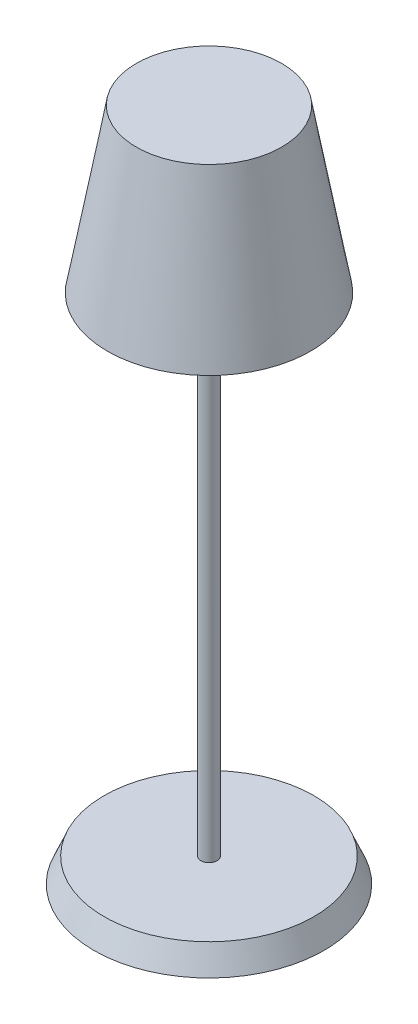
from build123d import *

# Parameters (mm, degrees)
CROQUIS1_W              = 5
CROQUIS1_H              = 330
CROQUIS4_R              = 45
SALIENTE_EXTRUIR2_DEPTH = 1


with BuildPart() as part:
    # Croquis1 → Revoluci_n1 (revolve)
    with BuildSketch(Plane.XY, mode=Mode.PRIVATE) as revoluci_n1_sk:
        Polygon((40, 417.946697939), (0, 417.946697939), (0, 345), (5, 345), align=None)
        with Locations((2.5, 180)):
            Rectangle(CROQUIS1_W, CROQUIS1_H)
        Polygon((5, 15), (0, 15), (0, 0), (71.296789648, 0), (65, 15), align=None)
    revolve(revoluci_n1_sk.sketch.rotate(Axis((0, 0, 0), (0, 1, 0)), 90), axis=Axis((0, 0, 0), (0, 1, 0)))



with BuildPart() as body_2:
    # Croquis3 → Revoluci_n3 (revolve)
    with BuildSketch(Plane.XY, mode=Mode.PRIVATE) as revoluci_n3_sk:
        Polygon((44.015661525, 417.770409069), (62.015661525, 317.264389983), (63, 317.440678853), (45, 417.946697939), align=None)
    revolve(revoluci_n3_sk.sketch.rotate(Axis((0, 417.770409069, 0), (0, 1, 0)), 90), axis=Axis((0, 417.770409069, 0), (0, 1, 0)))


with BuildPart() as part_1:
    add(part.part)

    add(body_2.part)  # Saliente-Extruir2 merges body 2
    # Croquis4 → Saliente-Extruir2 (add)
    with BuildSketch(Plane(origin=(0, 417.946697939, 0), x_dir=(1, 0, 0), z_dir=(0, 1, 0))):
        Circle(CROQUIS4_R)
    extrude(amount=-SALIENTE_EXTRUIR2_DEPTH)


solid = part_1.part
